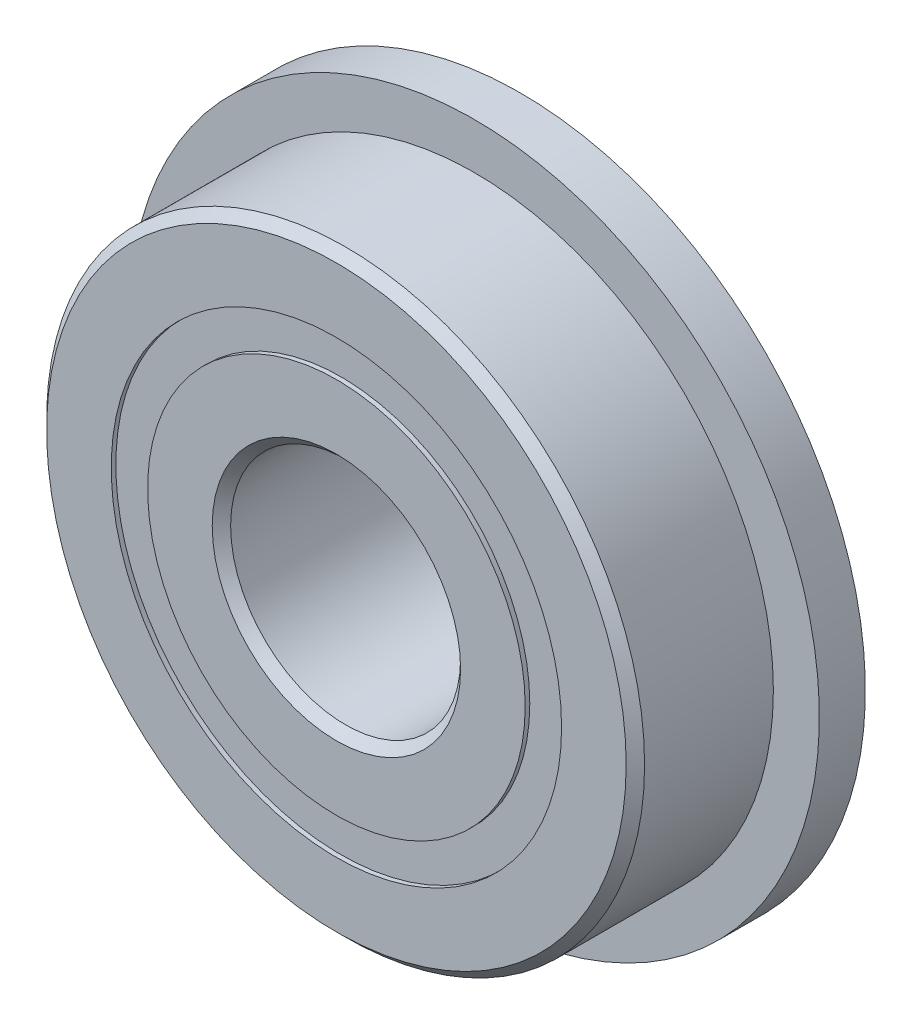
from build123d import *

# Parameters (mm, degrees)
CIRPATTERN1_COUNT = 12
SKETCH5_W         = 0.927052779
SKETCH5_H         = 0.791208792
SKETCH6_W         = 1
SKETCH6_H         = 2.604395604


with BuildPart() as part:
    # Sketch1 → Revolve1 (revolve)
    with BuildSketch(Plane(origin=(0, 0, 0), x_dir=(0, 0, -1), z_dir=(1, 0, 0)), mode=Mode.PRIVATE) as revolve1_sk:
        with BuildLine():
            Line((1.8, 6.5), (-1.8, 6.5))
            Line((-1.8, 6.5), (-2, 6.3))
            Line((-2, 6.3), (-2, 4.895604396))
            Line((-2, 4.895604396), (-0.888888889, 4.895604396))
            ThreePointArc((-0.888888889, 4.895604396), (0, 5.472947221), (0.888888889, 4.895604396))
            Line((0.888888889, 4.895604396), (2, 4.895604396))
            Line((2, 4.895604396), (2, 6.3))
            Line((2, 6.3), (1.8, 6.5))
        make_face()
    revolve(revolve1_sk.sketch.rotate(Axis((0, 0, 2), (0, 0, -1)), 90), axis=Axis((0, 0, 2), (0, 0, -1)))

    # Sketch6 → Revolve6 (revolve)
    with BuildSketch(Plane(origin=(0, 0, 0), x_dir=(0, 0, -1), z_dir=(1, 0, 0)), mode=Mode.PRIVATE) as revolve6_sk:
        with Locations((1.5, 6.197802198)):
            Rectangle(SKETCH6_W, SKETCH6_H)
    revolve(revolve6_sk.sketch.rotate(Axis((0, 0, -2), (0, 0, 1)), 270), axis=Axis((0, 0, -2), (0, 0, 1)))


with BuildPart() as body_2:
    # Sketch3 → Revolve3 (revolve)
    with BuildSketch(Plane(origin=(0, 0, 0), x_dir=(0, 0, -1), z_dir=(1, 0, 0)), mode=Mode.PRIVATE) as revolve3_sk:
        with BuildLine():
            Line((-2, 4.104395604), (-0.888888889, 4.104395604))
            ThreePointArc((-0.888888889, 4.104395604), (0, 3.527052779), (0.888888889, 4.104395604))
            Line((0.888888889, 4.104395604), (2, 4.104395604))
            Line((2, 4.104395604), (2, 2.7))
            Line((2, 2.7), (1.8, 2.5))
            Line((1.8, 2.5), (-1.8, 2.5))
            Line((-1.8, 2.5), (-2, 2.7))
            Line((-2, 2.7), (-2, 4.104395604))
        make_face()
    revolve(revolve3_sk.sketch.rotate(Axis((0, 0, 2), (0, 0, -1)), 90), axis=Axis((0, 0, 2), (0, 0, -1)))


with BuildPart() as body_3:
    # Sketch4 → Revolve4 (revolve)
    with BuildSketch(Plane(origin=(0, 0, 0), x_dir=(0, 0, -1), z_dir=(1, 0, 0))):
        with BuildLine():
            Line((-0.972947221, 4.5), (0.972947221, 4.5))
            ThreePointArc((0.972947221, 4.5), (0, 5.472947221), (-0.972947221, 4.5))
        make_face()
    revolve(axis=Axis((0, 4.5, 0.972947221), (0, 0, -1)))


with BuildPart() as cirpattern1_1:
    # CirPattern1: pattern copy
    add(body_3.part.rotate(Axis((0, 0, 0), (0, 0, 1)), 1 * 360 / CIRPATTERN1_COUNT))


with BuildPart() as cirpattern1_2:
    # CirPattern1: pattern copy
    add(body_3.part.rotate(Axis((0, 0, 0), (0, 0, 1)), 2 * 360 / CIRPATTERN1_COUNT))


with BuildPart() as cirpattern1_3:
    # CirPattern1: pattern copy
    add(body_3.part.rotate(Axis((0, 0, 0), (0, 0, 1)), 3 * 360 / CIRPATTERN1_COUNT))


with BuildPart() as cirpattern1_4:
    # CirPattern1: pattern copy
    add(body_3.part.rotate(Axis((0, 0, 0), (0, 0, 1)), 4 * 360 / CIRPATTERN1_COUNT))


with BuildPart() as cirpattern1_5:
    # CirPattern1: pattern copy
    add(body_3.part.rotate(Axis((0, 0, 0), (0, 0, 1)), 5 * 360 / CIRPATTERN1_COUNT))


with BuildPart() as cirpattern1_6:
    # CirPattern1: pattern copy
    add(body_3.part.rotate(Axis((0, 0, 0), (0, 0, 1)), 6 * 360 / CIRPATTERN1_COUNT))


with BuildPart() as cirpattern1_7:
    # CirPattern1: pattern copy
    add(body_3.part.rotate(Axis((0, 0, 0), (0, 0, 1)), 7 * 360 / CIRPATTERN1_COUNT))


with BuildPart() as cirpattern1_8:
    # CirPattern1: pattern copy
    add(body_3.part.rotate(Axis((0, 0, 0), (0, 0, 1)), 8 * 360 / CIRPATTERN1_COUNT))


with BuildPart() as cirpattern1_9:
    # CirPattern1: pattern copy
    add(body_3.part.rotate(Axis((0, 0, 0), (0, 0, 1)), 9 * 360 / CIRPATTERN1_COUNT))


with BuildPart() as cirpattern1_10:
    # CirPattern1: pattern copy
    add(body_3.part.rotate(Axis((0, 0, 0), (0, 0, 1)), 10 * 360 / CIRPATTERN1_COUNT))


with BuildPart() as cirpattern1_11:
    # CirPattern1: pattern copy
    add(body_3.part.rotate(Axis((0, 0, 0), (0, 0, 1)), 11 * 360 / CIRPATTERN1_COUNT))


with BuildPart() as body_15:
    # Sketch5 → Revolve5 (revolve)
    with BuildSketch(Plane(origin=(0, 0, 0), x_dir=(0, 0, -1), z_dir=(1, 0, 0)), mode=Mode.PRIVATE) as revolve5_sk:
        with Locations((-1.436473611, 4.5)):
            Rectangle(SKETCH5_W, SKETCH5_H)
        with Locations((1.436473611, 4.5)):
            Rectangle(SKETCH5_W, SKETCH5_H)
    revolve(revolve5_sk.sketch.rotate(Axis((0, 0, 2), (0, 0, -1)), 90), axis=Axis((0, 0, 2), (0, 0, -1)))


solid = Compound([part.part, body_2.part, body_3.part, cirpattern1_1.part, cirpattern1_2.part, cirpattern1_3.part, cirpattern1_4.part, cirpattern1_5.part, cirpattern1_6.part, cirpattern1_7.part, cirpattern1_8.part, cirpattern1_9.part, cirpattern1_10.part, cirpattern1_11.part, body_15.part])
